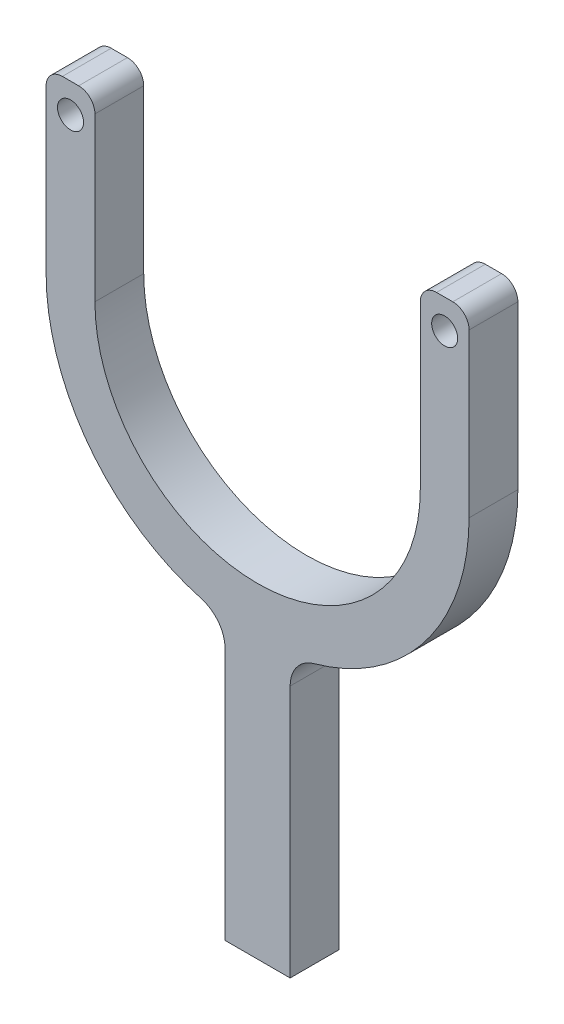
ISO-10303-21;
HEADER;
FILE_DESCRIPTION(('STEP AP214'),'2;1');
FILE_NAME('part.step','',(''),(''),'','','');
FILE_SCHEMA(('AUTOMOTIVE_DESIGN { 1 0 10303 214 1 1 1 1 }'));
ENDSEC;
DATA;
#1=APPLICATION_CONTEXT('core data for automotive mechanical design processes');
#2=APPLICATION_PROTOCOL_DEFINITION('international standard','automotive_design',2000,#1);
#3=PRODUCT_CONTEXT('',#1,'mechanical');
#4=PRODUCT('Part','Part','',(#3));
#5=PRODUCT_RELATED_PRODUCT_CATEGORY('part','',(#4));
#6=PRODUCT_DEFINITION_FORMATION('','',#4);
#7=PRODUCT_DEFINITION_CONTEXT('part definition',#1,'design');
#8=PRODUCT_DEFINITION('design','',#6,#7);
#9=PRODUCT_DEFINITION_SHAPE('','',#8);
#10=(LENGTH_UNIT() NAMED_UNIT(*) SI_UNIT(.MILLI.,.METRE.));
#11=(NAMED_UNIT(*) PLANE_ANGLE_UNIT() SI_UNIT($,.RADIAN.));
#12=(NAMED_UNIT(*) SI_UNIT($,.STERADIAN.) SOLID_ANGLE_UNIT());
#13=UNCERTAINTY_MEASURE_WITH_UNIT(LENGTH_MEASURE(1.E-05),#10,'distance_accuracy_value','');
#14=(GEOMETRIC_REPRESENTATION_CONTEXT(3) GLOBAL_UNCERTAINTY_ASSIGNED_CONTEXT((#13)) GLOBAL_UNIT_ASSIGNED_CONTEXT((#10,
#11,#12)) REPRESENTATION_CONTEXT('',''));
#15=CARTESIAN_POINT('',(0.,0.,0.));
#16=DIRECTION('',(0.,0.,1.));
#17=DIRECTION('',(1.,0.,0.));
#18=AXIS2_PLACEMENT_3D('',#15,#16,#17);
#19=CARTESIAN_POINT('',(0.,0.,7.5));
#20=DIRECTION('',(1.,0.,0.));
#21=DIRECTION('',(0.,1.,0.));
#22=AXIS2_PLACEMENT_3D('',#19,#20,#21);
#23=PLANE('',#22);
#24=DIRECTION('',(0.,-1.,0.));
#25=VECTOR('',#24,1.);
#26=CARTESIAN_POINT('',(0.,0.,7.5));
#27=LINE('',#26,#25);
#28=CARTESIAN_POINT('',(0.,-22.2841614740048,7.5));
#29=VERTEX_POINT('',#28);
#30=CARTESIAN_POINT('',(0.,-100.,7.5));
#31=VERTEX_POINT('',#30);
#32=EDGE_CURVE('E229',#29,#31,#27,.T.);
#33=ORIENTED_EDGE('',*,*,#32,.F.);
#34=DIRECTION('',(0.,0.,1.));
#35=VECTOR('',#34,1.);
#36=CARTESIAN_POINT('',(0.,-22.2841614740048,-7.5));
#37=LINE('',#36,#35);
#38=CARTESIAN_POINT('',(0.,-22.2841614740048,-7.5));
#39=VERTEX_POINT('',#38);
#40=EDGE_CURVE('E256',#29,#39,#37,.F.);
#41=ORIENTED_EDGE('',*,*,#40,.T.);
#42=DIRECTION('',(0.,-1.,0.));
#43=VECTOR('',#42,1.);
#44=CARTESIAN_POINT('',(0.,0.,-7.5));
#45=LINE('',#44,#43);
#46=CARTESIAN_POINT('',(0.,-100.,-7.5));
#47=VERTEX_POINT('',#46);
#48=EDGE_CURVE('E178',#39,#47,#45,.T.);
#49=ORIENTED_EDGE('',*,*,#48,.T.);
#50=DIRECTION('',(0.,0.,-1.));
#51=VECTOR('',#50,1.);
#52=CARTESIAN_POINT('',(0.,-100.,7.5));
#53=LINE('',#52,#51);
#54=EDGE_CURVE('E245',#31,#47,#53,.T.);
#55=ORIENTED_EDGE('',*,*,#54,.F.);
#56=EDGE_LOOP('',(#33,#41,#49,#55));
#57=FACE_BOUND('',#56,.T.);
#58=ADVANCED_FACE('F32',(#57),#23,.F.);
#59=CARTESIAN_POINT('',(20.,0.,7.5));
#60=DIRECTION('',(-1.,0.,0.));
#61=DIRECTION('',(0.,-1.,0.));
#62=AXIS2_PLACEMENT_3D('',#59,#60,#61);
#63=PLANE('',#62);
#64=DIRECTION('',(0.,1.,0.));
#65=VECTOR('',#64,1.);
#66=CARTESIAN_POINT('',(20.,0.,-7.5));
#67=LINE('',#66,#65);
#68=CARTESIAN_POINT('',(20.,-100.,-7.5));
#69=VERTEX_POINT('',#68);
#70=CARTESIAN_POINT('',(20.,-22.2841614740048,-7.5));
#71=VERTEX_POINT('',#70);
#72=EDGE_CURVE('E232',#69,#71,#67,.T.);
#73=ORIENTED_EDGE('',*,*,#72,.T.);
#74=DIRECTION('',(0.,0.,1.));
#75=VECTOR('',#74,1.);
#76=CARTESIAN_POINT('',(20.,-22.2841614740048,7.5));
#77=LINE('',#76,#75);
#78=CARTESIAN_POINT('',(20.,-22.2841614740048,7.5));
#79=VERTEX_POINT('',#78);
#80=EDGE_CURVE('E251',#71,#79,#77,.T.);
#81=ORIENTED_EDGE('',*,*,#80,.T.);
#82=DIRECTION('',(0.,1.,0.));
#83=VECTOR('',#82,1.);
#84=CARTESIAN_POINT('',(20.,0.,7.5));
#85=LINE('',#84,#83);
#86=CARTESIAN_POINT('',(20.,-100.,7.5));
#87=VERTEX_POINT('',#86);
#88=EDGE_CURVE('E234',#87,#79,#85,.T.);
#89=ORIENTED_EDGE('',*,*,#88,.F.);
#90=DIRECTION('',(0.,0.,-1.));
#91=VECTOR('',#90,1.);
#92=CARTESIAN_POINT('',(20.,-100.,7.5));
#93=LINE('',#92,#91);
#94=EDGE_CURVE('E237',#87,#69,#93,.T.);
#95=ORIENTED_EDGE('',*,*,#94,.T.);
#96=EDGE_LOOP('',(#73,#81,#89,#95));
#97=FACE_BOUND('',#96,.T.);
#98=ADVANCED_FACE('F366',(#97),#63,.F.);
#99=CARTESIAN_POINT('',(0.,-100.,7.5));
#100=DIRECTION('',(0.,1.,0.));
#101=DIRECTION('',(0.,0.,1.));
#102=AXIS2_PLACEMENT_3D('',#99,#100,#101);
#103=PLANE('',#102);
#104=DIRECTION('',(1.,0.,0.));
#105=VECTOR('',#104,1.);
#106=CARTESIAN_POINT('',(0.,-100.,-7.5));
#107=LINE('',#106,#105);
#108=EDGE_CURVE('E239',#47,#69,#107,.T.);
#109=ORIENTED_EDGE('',*,*,#108,.T.);
#110=ORIENTED_EDGE('',*,*,#94,.F.);
#111=DIRECTION('',(1.,0.,0.));
#112=VECTOR('',#111,1.);
#113=CARTESIAN_POINT('',(0.,-100.,7.5));
#114=LINE('',#113,#112);
#115=EDGE_CURVE('E231',#31,#87,#114,.T.);
#116=ORIENTED_EDGE('',*,*,#115,.F.);
#117=ORIENTED_EDGE('',*,*,#54,.T.);
#118=EDGE_LOOP('',(#109,#110,#116,#117));
#119=FACE_BOUND('',#118,.T.);
#120=ADVANCED_FACE('F329',(#119),#103,.F.);
#121=CARTESIAN_POINT('',(0.,-100.,7.5));
#122=DIRECTION('',(0.,0.,1.));
#123=DIRECTION('',(1.,0.,0.));
#124=AXIS2_PLACEMENT_3D('',#121,#122,#123);
#125=PLANE('',#124);
#126=CARTESIAN_POINT('',(67.5,96.,7.5));
#127=DIRECTION('',(0.,0.,1.));
#128=DIRECTION('',(1.,0.,0.));
#129=AXIS2_PLACEMENT_3D('',#126,#127,#128);
#130=CIRCLE('',#129,4.00000000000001);
#131=CARTESIAN_POINT('',(71.5,96.,7.5));
#132=VERTEX_POINT('',#131);
#133=EDGE_CURVE('E424',#132,#132,#130,.T.);
#134=ORIENTED_EDGE('',*,*,#133,.F.);
#135=EDGE_LOOP('',(#134));
#136=FACE_BOUND('',#135,.T.);
#137=CARTESIAN_POINT('',(-47.5,96.,7.5));
#138=DIRECTION('',(0.,0.,1.));
#139=DIRECTION('',(1.,0.,0.));
#140=AXIS2_PLACEMENT_3D('',#137,#138,#139);
#141=CIRCLE('',#140,4.00000000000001);
#142=CARTESIAN_POINT('',(-43.5,96.,7.5));
#143=VERTEX_POINT('',#142);
#144=EDGE_CURVE('E419',#143,#143,#141,.T.);
#145=ORIENTED_EDGE('',*,*,#144,.F.);
#146=EDGE_LOOP('',(#145));
#147=FACE_BOUND('',#146,.T.);
#148=DIRECTION('',(0.,1.,0.));
#149=VECTOR('',#148,1.);
#150=CARTESIAN_POINT('',(75.,50.,7.5));
#151=LINE('',#150,#149);
#152=CARTESIAN_POINT('',(75.,50.,7.5));
#153=VERTEX_POINT('',#152);
#154=CARTESIAN_POINT('',(75.,100.,7.5));
#155=VERTEX_POINT('',#154);
#156=EDGE_CURVE('E188',#153,#155,#151,.T.);
#157=ORIENTED_EDGE('',*,*,#156,.T.);
#158=CARTESIAN_POINT('',(70.,100.,7.5));
#159=DIRECTION('',(0.,0.,1.));
#160=DIRECTION('',(1.,0.,0.));
#161=AXIS2_PLACEMENT_3D('',#158,#159,#160);
#162=CIRCLE('',#161,5.);
#163=CARTESIAN_POINT('',(70.,105.,7.5));
#164=VERTEX_POINT('',#163);
#165=EDGE_CURVE('E284',#155,#164,#162,.T.);
#166=ORIENTED_EDGE('',*,*,#165,.T.);
#167=DIRECTION('',(1.,0.,0.));
#168=VECTOR('',#167,1.);
#169=CARTESIAN_POINT('',(60.,105.,7.5));
#170=LINE('',#169,#168);
#171=CARTESIAN_POINT('',(65.,105.,7.5));
#172=VERTEX_POINT('',#171);
#173=EDGE_CURVE('E185',#172,#164,#170,.T.);
#174=ORIENTED_EDGE('',*,*,#173,.F.);
#175=CARTESIAN_POINT('',(65.,100.,7.5));
#176=DIRECTION('',(0.,0.,1.));
#177=DIRECTION('',(1.,0.,0.));
#178=AXIS2_PLACEMENT_3D('',#175,#176,#177);
#179=CIRCLE('',#178,5.);
#180=CARTESIAN_POINT('',(60.,100.,7.5));
#181=VERTEX_POINT('',#180);
#182=EDGE_CURVE('E184',#172,#181,#179,.T.);
#183=ORIENTED_EDGE('',*,*,#182,.T.);
#184=DIRECTION('',(0.,1.,0.));
#185=VECTOR('',#184,1.);
#186=CARTESIAN_POINT('',(60.,50.,7.5));
#187=LINE('',#186,#185);
#188=CARTESIAN_POINT('',(60.,50.,7.5));
#189=VERTEX_POINT('',#188);
#190=EDGE_CURVE('E169',#189,#181,#187,.T.);
#191=ORIENTED_EDGE('',*,*,#190,.F.);
#192=CARTESIAN_POINT('',(10.,50.,7.5));
#193=DIRECTION('',(0.,0.,1.));
#194=DIRECTION('',(1.,0.,0.));
#195=AXIS2_PLACEMENT_3D('',#192,#193,#194);
#196=CIRCLE('',#195,50.);
#197=CARTESIAN_POINT('',(-40.,50.,7.5));
#198=VERTEX_POINT('',#197);
#199=EDGE_CURVE('E159',#198,#189,#196,.T.);
#200=ORIENTED_EDGE('',*,*,#199,.F.);
#201=DIRECTION('',(0.,-1.,0.));
#202=VECTOR('',#201,1.);
#203=CARTESIAN_POINT('',(-40.,50.,7.5));
#204=LINE('',#203,#202);
#205=CARTESIAN_POINT('',(-40.,100.,7.5));
#206=VERTEX_POINT('',#205);
#207=EDGE_CURVE('E168',#206,#198,#204,.T.);
#208=ORIENTED_EDGE('',*,*,#207,.F.);
#209=CARTESIAN_POINT('',(-45.,100.,7.5));
#210=DIRECTION('',(0.,0.,1.));
#211=DIRECTION('',(1.,0.,0.));
#212=AXIS2_PLACEMENT_3D('',#209,#210,#211);
#213=CIRCLE('',#212,5.);
#214=CARTESIAN_POINT('',(-45.,105.,7.5));
#215=VERTEX_POINT('',#214);
#216=EDGE_CURVE('E53',#206,#215,#213,.T.);
#217=ORIENTED_EDGE('',*,*,#216,.T.);
#218=DIRECTION('',(1.,0.,0.));
#219=VECTOR('',#218,1.);
#220=CARTESIAN_POINT('',(-55.,105.,7.5));
#221=LINE('',#220,#219);
#222=CARTESIAN_POINT('',(-50.,105.,7.5));
#223=VERTEX_POINT('',#222);
#224=EDGE_CURVE('E193',#223,#215,#221,.T.);
#225=ORIENTED_EDGE('',*,*,#224,.F.);
#226=CARTESIAN_POINT('',(-50.,100.,7.5));
#227=DIRECTION('',(0.,0.,1.));
#228=DIRECTION('',(1.,0.,0.));
#229=AXIS2_PLACEMENT_3D('',#226,#227,#228);
#230=CIRCLE('',#229,5.);
#231=CARTESIAN_POINT('',(-55.,100.,7.5));
#232=VERTEX_POINT('',#231);
#233=EDGE_CURVE('E47',#223,#232,#230,.T.);
#234=ORIENTED_EDGE('',*,*,#233,.T.);
#235=DIRECTION('',(0.,-1.,0.));
#236=VECTOR('',#235,1.);
#237=CARTESIAN_POINT('',(-55.,50.,7.5));
#238=LINE('',#237,#236);
#239=CARTESIAN_POINT('',(-55.,50.,7.5));
#240=VERTEX_POINT('',#239);
#241=EDGE_CURVE('E195',#232,#240,#238,.T.);
#242=ORIENTED_EDGE('',*,*,#241,.T.);
#243=CARTESIAN_POINT('',(10.,50.,7.5));
#244=DIRECTION('',(0.,0.,1.));
#245=DIRECTION('',(1.,0.,0.));
#246=AXIS2_PLACEMENT_3D('',#243,#244,#245);
#247=CIRCLE('',#246,65.);
#248=CARTESIAN_POINT('',(-7.33333333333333,-12.6462732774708,7.5));
#249=VERTEX_POINT('',#248);
#250=EDGE_CURVE('E198',#240,#249,#247,.T.);
#251=ORIENTED_EDGE('',*,*,#250,.T.);
#252=CARTESIAN_POINT('',(-10.,-22.2841614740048,7.5));
#253=DIRECTION('',(0.,0.,1.));
#254=DIRECTION('',(1.,0.,0.));
#255=AXIS2_PLACEMENT_3D('',#252,#253,#254);
#256=CIRCLE('',#255,10.);
#257=EDGE_CURVE('E262',#249,#29,#256,.F.);
#258=ORIENTED_EDGE('',*,*,#257,.T.);
#259=ORIENTED_EDGE('',*,*,#32,.T.);
#260=ORIENTED_EDGE('',*,*,#115,.T.);
#261=ORIENTED_EDGE('',*,*,#88,.T.);
#262=CARTESIAN_POINT('',(30.,-22.2841614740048,7.5));
#263=DIRECTION('',(0.,0.,1.));
#264=DIRECTION('',(1.,0.,0.));
#265=AXIS2_PLACEMENT_3D('',#262,#263,#264);
#266=CIRCLE('',#265,10.);
#267=CARTESIAN_POINT('',(27.3333333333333,-12.6462732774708,7.5));
#268=VERTEX_POINT('',#267);
#269=EDGE_CURVE('E260',#79,#268,#266,.F.);
#270=ORIENTED_EDGE('',*,*,#269,.T.);
#271=EDGE_CURVE('E197',#268,#153,#247,.T.);
#272=ORIENTED_EDGE('',*,*,#271,.T.);
#273=EDGE_LOOP('',(#157,#166,#174,#183,#191,#200,#208,#217,#225,#234,#242,#251,#258,#259,#260,
#261,#270,#272));
#274=FACE_BOUND('',#273,.T.);
#275=ADVANCED_FACE('F181',(#136,#147,#274),#125,.T.);
#276=CARTESIAN_POINT('',(0.,-100.,-7.5));
#277=DIRECTION('',(0.,0.,1.));
#278=DIRECTION('',(1.,0.,0.));
#279=AXIS2_PLACEMENT_3D('',#276,#277,#278);
#280=PLANE('',#279);
#281=CARTESIAN_POINT('',(67.5,96.,-7.5));
#282=DIRECTION('',(0.,0.,1.));
#283=DIRECTION('',(1.,0.,0.));
#284=AXIS2_PLACEMENT_3D('',#281,#282,#283);
#285=CIRCLE('',#284,4.00000000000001);
#286=CARTESIAN_POINT('',(71.5,96.,-7.5));
#287=VERTEX_POINT('',#286);
#288=EDGE_CURVE('E417',#287,#287,#285,.T.);
#289=ORIENTED_EDGE('',*,*,#288,.T.);
#290=EDGE_LOOP('',(#289));
#291=FACE_BOUND('',#290,.T.);
#292=CARTESIAN_POINT('',(-47.5,96.,-7.5));
#293=DIRECTION('',(0.,0.,1.));
#294=DIRECTION('',(1.,0.,0.));
#295=AXIS2_PLACEMENT_3D('',#292,#293,#294);
#296=CIRCLE('',#295,4.00000000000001);
#297=CARTESIAN_POINT('',(-43.5,96.,-7.5));
#298=VERTEX_POINT('',#297);
#299=EDGE_CURVE('E206',#298,#298,#296,.T.);
#300=ORIENTED_EDGE('',*,*,#299,.T.);
#301=EDGE_LOOP('',(#300));
#302=FACE_BOUND('',#301,.T.);
#303=DIRECTION('',(1.,0.,0.));
#304=VECTOR('',#303,1.);
#305=CARTESIAN_POINT('',(60.,105.,-7.5));
#306=LINE('',#305,#304);
#307=CARTESIAN_POINT('',(65.,105.,-7.5));
#308=VERTEX_POINT('',#307);
#309=CARTESIAN_POINT('',(70.,105.,-7.5));
#310=VERTEX_POINT('',#309);
#311=EDGE_CURVE('E205',#308,#310,#306,.T.);
#312=ORIENTED_EDGE('',*,*,#311,.T.);
#313=CARTESIAN_POINT('',(70.,100.,-7.5));
#314=DIRECTION('',(0.,0.,1.));
#315=DIRECTION('',(1.,0.,0.));
#316=AXIS2_PLACEMENT_3D('',#313,#314,#315);
#317=CIRCLE('',#316,5.);
#318=CARTESIAN_POINT('',(75.,100.,-7.5));
#319=VERTEX_POINT('',#318);
#320=EDGE_CURVE('E277',#310,#319,#317,.F.);
#321=ORIENTED_EDGE('',*,*,#320,.T.);
#322=DIRECTION('',(0.,1.,0.));
#323=VECTOR('',#322,1.);
#324=CARTESIAN_POINT('',(75.,50.,-7.5));
#325=LINE('',#324,#323);
#326=CARTESIAN_POINT('',(75.,50.,-7.5));
#327=VERTEX_POINT('',#326);
#328=EDGE_CURVE('E202',#327,#319,#325,.T.);
#329=ORIENTED_EDGE('',*,*,#328,.F.);
#330=CARTESIAN_POINT('',(10.,50.,-7.5));
#331=DIRECTION('',(0.,0.,1.));
#332=DIRECTION('',(1.,0.,0.));
#333=AXIS2_PLACEMENT_3D('',#330,#331,#332);
#334=CIRCLE('',#333,65.);
#335=CARTESIAN_POINT('',(27.3333333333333,-12.6462732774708,-7.5));
#336=VERTEX_POINT('',#335);
#337=EDGE_CURVE('E219',#336,#327,#334,.T.);
#338=ORIENTED_EDGE('',*,*,#337,.F.);
#339=CARTESIAN_POINT('',(30.,-22.2841614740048,-7.5));
#340=DIRECTION('',(0.,0.,1.));
#341=DIRECTION('',(1.,0.,0.));
#342=AXIS2_PLACEMENT_3D('',#339,#340,#341);
#343=CIRCLE('',#342,10.);
#344=EDGE_CURVE('E258',#336,#71,#343,.T.);
#345=ORIENTED_EDGE('',*,*,#344,.T.);
#346=ORIENTED_EDGE('',*,*,#72,.F.);
#347=ORIENTED_EDGE('',*,*,#108,.F.);
#348=ORIENTED_EDGE('',*,*,#48,.F.);
#349=CARTESIAN_POINT('',(-10.,-22.2841614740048,-7.5));
#350=DIRECTION('',(0.,0.,1.));
#351=DIRECTION('',(1.,0.,0.));
#352=AXIS2_PLACEMENT_3D('',#349,#350,#351);
#353=CIRCLE('',#352,10.);
#354=CARTESIAN_POINT('',(-7.33333333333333,-12.6462732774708,-7.5));
#355=VERTEX_POINT('',#354);
#356=EDGE_CURVE('E264',#39,#355,#353,.T.);
#357=ORIENTED_EDGE('',*,*,#356,.T.);
#358=CARTESIAN_POINT('',(-55.,50.,-7.5));
#359=VERTEX_POINT('',#358);
#360=EDGE_CURVE('E220',#359,#355,#334,.T.);
#361=ORIENTED_EDGE('',*,*,#360,.F.);
#362=DIRECTION('',(0.,-1.,0.));
#363=VECTOR('',#362,1.);
#364=CARTESIAN_POINT('',(-55.,50.,-7.5));
#365=LINE('',#364,#363);
#366=CARTESIAN_POINT('',(-55.,100.,-7.5));
#367=VERTEX_POINT('',#366);
#368=EDGE_CURVE('E217',#367,#359,#365,.T.);
#369=ORIENTED_EDGE('',*,*,#368,.F.);
#370=CARTESIAN_POINT('',(-50.,100.,-7.5));
#371=DIRECTION('',(0.,0.,1.));
#372=DIRECTION('',(1.,0.,0.));
#373=AXIS2_PLACEMENT_3D('',#370,#371,#372);
#374=CIRCLE('',#373,5.);
#375=CARTESIAN_POINT('',(-50.,105.,-7.5));
#376=VERTEX_POINT('',#375);
#377=EDGE_CURVE('E271',#367,#376,#374,.F.);
#378=ORIENTED_EDGE('',*,*,#377,.T.);
#379=DIRECTION('',(1.,0.,0.));
#380=VECTOR('',#379,1.);
#381=CARTESIAN_POINT('',(-55.,105.,-7.5));
#382=LINE('',#381,#380);
#383=CARTESIAN_POINT('',(-45.,105.,-7.5));
#384=VERTEX_POINT('',#383);
#385=EDGE_CURVE('E214',#376,#384,#382,.T.);
#386=ORIENTED_EDGE('',*,*,#385,.T.);
#387=CARTESIAN_POINT('',(-45.,100.,-7.5));
#388=DIRECTION('',(0.,0.,1.));
#389=DIRECTION('',(1.,0.,0.));
#390=AXIS2_PLACEMENT_3D('',#387,#388,#389);
#391=CIRCLE('',#390,5.);
#392=CARTESIAN_POINT('',(-40.,100.,-7.5));
#393=VERTEX_POINT('',#392);
#394=EDGE_CURVE('E273',#384,#393,#391,.F.);
#395=ORIENTED_EDGE('',*,*,#394,.T.);
#396=DIRECTION('',(0.,-1.,0.));
#397=VECTOR('',#396,1.);
#398=CARTESIAN_POINT('',(-40.,50.,-7.5));
#399=LINE('',#398,#397);
#400=CARTESIAN_POINT('',(-40.,50.,-7.5));
#401=VERTEX_POINT('',#400);
#402=EDGE_CURVE('E212',#393,#401,#399,.T.);
#403=ORIENTED_EDGE('',*,*,#402,.T.);
#404=CARTESIAN_POINT('',(10.,50.,-7.5));
#405=DIRECTION('',(0.,0.,1.));
#406=DIRECTION('',(1.,0.,0.));
#407=AXIS2_PLACEMENT_3D('',#404,#405,#406);
#408=CIRCLE('',#407,50.);
#409=CARTESIAN_POINT('',(60.,50.,-7.5));
#410=VERTEX_POINT('',#409);
#411=EDGE_CURVE('E210',#401,#410,#408,.T.);
#412=ORIENTED_EDGE('',*,*,#411,.T.);
#413=DIRECTION('',(0.,1.,0.));
#414=VECTOR('',#413,1.);
#415=CARTESIAN_POINT('',(60.,50.,-7.5));
#416=LINE('',#415,#414);
#417=CARTESIAN_POINT('',(60.,100.,-7.5));
#418=VERTEX_POINT('',#417);
#419=EDGE_CURVE('E177',#410,#418,#416,.T.);
#420=ORIENTED_EDGE('',*,*,#419,.T.);
#421=CARTESIAN_POINT('',(65.,100.,-7.5));
#422=DIRECTION('',(0.,0.,1.));
#423=DIRECTION('',(1.,0.,0.));
#424=AXIS2_PLACEMENT_3D('',#421,#422,#423);
#425=CIRCLE('',#424,5.);
#426=EDGE_CURVE('E275',#418,#308,#425,.F.);
#427=ORIENTED_EDGE('',*,*,#426,.T.);
#428=EDGE_LOOP('',(#312,#321,#329,#338,#345,#346,#347,#348,#357,#361,#369,#378,#386,#395,#403,
#412,#420,#427));
#429=FACE_BOUND('',#428,.T.);
#430=ADVANCED_FACE('F304',(#291,#302,#429),#280,.F.);
#431=CARTESIAN_POINT('',(10.,50.,7.5));
#432=DIRECTION('',(0.,0.,-1.));
#433=DIRECTION('',(-1.,0.,0.));
#434=AXIS2_PLACEMENT_3D('',#431,#432,#433);
#435=CYLINDRICAL_SURFACE('',#434,50.);
#436=ORIENTED_EDGE('',*,*,#199,.T.);
#437=DIRECTION('',(0.,0.,-1.));
#438=VECTOR('',#437,1.);
#439=CARTESIAN_POINT('',(60.,50.,7.5));
#440=LINE('',#439,#438);
#441=EDGE_CURVE('E163',#189,#410,#440,.T.);
#442=ORIENTED_EDGE('',*,*,#441,.T.);
#443=ORIENTED_EDGE('',*,*,#411,.F.);
#444=DIRECTION('',(0.,0.,-1.));
#445=VECTOR('',#444,1.);
#446=CARTESIAN_POINT('',(-40.,50.,7.5));
#447=LINE('',#446,#445);
#448=EDGE_CURVE('E166',#198,#401,#447,.T.);
#449=ORIENTED_EDGE('',*,*,#448,.F.);
#450=EDGE_LOOP('',(#436,#442,#443,#449));
#451=FACE_BOUND('',#450,.T.);
#452=ADVANCED_FACE('F161',(#451),#435,.F.);
#453=CARTESIAN_POINT('',(10.,50.,7.5));
#454=DIRECTION('',(0.,0.,-1.));
#455=DIRECTION('',(-1.,0.,0.));
#456=AXIS2_PLACEMENT_3D('',#453,#454,#455);
#457=CYLINDRICAL_SURFACE('',#456,65.);
#458=ORIENTED_EDGE('',*,*,#360,.T.);
#459=DIRECTION('',(0.,0.,-1.));
#460=VECTOR('',#459,1.);
#461=CARTESIAN_POINT('',(-7.33333333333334,-12.6462732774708,7.5));
#462=LINE('',#461,#460);
#463=EDGE_CURVE('E253',#355,#249,#462,.F.);
#464=ORIENTED_EDGE('',*,*,#463,.T.);
#465=ORIENTED_EDGE('',*,*,#250,.F.);
#466=DIRECTION('',(0.,0.,-1.));
#467=VECTOR('',#466,1.);
#468=CARTESIAN_POINT('',(-55.,50.,7.5));
#469=LINE('',#468,#467);
#470=EDGE_CURVE('E225',#240,#359,#469,.T.);
#471=ORIENTED_EDGE('',*,*,#470,.T.);
#472=EDGE_LOOP('',(#458,#464,#465,#471));
#473=FACE_BOUND('',#472,.T.);
#474=ADVANCED_FACE('F315',(#473),#457,.T.);
#475=ORIENTED_EDGE('',*,*,#271,.F.);
#476=DIRECTION('',(0.,0.,-1.));
#477=VECTOR('',#476,1.);
#478=CARTESIAN_POINT('',(27.3333333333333,-12.6462732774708,7.5));
#479=LINE('',#478,#477);
#480=EDGE_CURVE('E248',#268,#336,#479,.T.);
#481=ORIENTED_EDGE('',*,*,#480,.T.);
#482=ORIENTED_EDGE('',*,*,#337,.T.);
#483=DIRECTION('',(0.,0.,-1.));
#484=VECTOR('',#483,1.);
#485=CARTESIAN_POINT('',(75.,50.,7.5));
#486=LINE('',#485,#484);
#487=EDGE_CURVE('E201',#153,#327,#486,.T.);
#488=ORIENTED_EDGE('',*,*,#487,.F.);
#489=EDGE_LOOP('',(#475,#481,#482,#488));
#490=FACE_BOUND('',#489,.T.);
#491=ADVANCED_FACE('F340',(#490),#457,.T.);
#492=CARTESIAN_POINT('',(75.,50.,7.5));
#493=DIRECTION('',(-1.,0.,0.));
#494=DIRECTION('',(0.,-1.,0.));
#495=AXIS2_PLACEMENT_3D('',#492,#493,#494);
#496=PLANE('',#495);
#497=ORIENTED_EDGE('',*,*,#328,.T.);
#498=DIRECTION('',(0.,0.,-1.));
#499=VECTOR('',#498,1.);
#500=CARTESIAN_POINT('',(75.,100.,7.5));
#501=LINE('',#500,#499);
#502=EDGE_CURVE('E279',#319,#155,#501,.F.);
#503=ORIENTED_EDGE('',*,*,#502,.T.);
#504=ORIENTED_EDGE('',*,*,#156,.F.);
#505=ORIENTED_EDGE('',*,*,#487,.T.);
#506=EDGE_LOOP('',(#497,#503,#504,#505));
#507=FACE_BOUND('',#506,.T.);
#508=ADVANCED_FACE('F345',(#507),#496,.F.);
#509=CARTESIAN_POINT('',(60.,105.,7.5));
#510=DIRECTION('',(0.,1.,0.));
#511=DIRECTION('',(0.,0.,1.));
#512=AXIS2_PLACEMENT_3D('',#509,#510,#511);
#513=PLANE('',#512);
#514=ORIENTED_EDGE('',*,*,#173,.T.);
#515=DIRECTION('',(0.,0.,-1.));
#516=VECTOR('',#515,1.);
#517=CARTESIAN_POINT('',(70.,105.,-7.5));
#518=LINE('',#517,#516);
#519=EDGE_CURVE('E268',#164,#310,#518,.T.);
#520=ORIENTED_EDGE('',*,*,#519,.T.);
#521=ORIENTED_EDGE('',*,*,#311,.F.);
#522=DIRECTION('',(0.,0.,-1.));
#523=VECTOR('',#522,1.);
#524=CARTESIAN_POINT('',(65.,105.,7.5));
#525=LINE('',#524,#523);
#526=EDGE_CURVE('E266',#308,#172,#525,.F.);
#527=ORIENTED_EDGE('',*,*,#526,.T.);
#528=EDGE_LOOP('',(#514,#520,#521,#527));
#529=FACE_BOUND('',#528,.T.);
#530=ADVANCED_FACE('F352',(#529),#513,.T.);
#531=CARTESIAN_POINT('',(60.,50.,7.5));
#532=DIRECTION('',(-1.,0.,0.));
#533=DIRECTION('',(0.,-1.,0.));
#534=AXIS2_PLACEMENT_3D('',#531,#532,#533);
#535=PLANE('',#534);
#536=ORIENTED_EDGE('',*,*,#190,.T.);
#537=DIRECTION('',(0.,0.,-1.));
#538=VECTOR('',#537,1.);
#539=CARTESIAN_POINT('',(60.,100.,7.5));
#540=LINE('',#539,#538);
#541=EDGE_CURVE('E286',#181,#418,#540,.T.);
#542=ORIENTED_EDGE('',*,*,#541,.T.);
#543=ORIENTED_EDGE('',*,*,#419,.F.);
#544=ORIENTED_EDGE('',*,*,#441,.F.);
#545=EDGE_LOOP('',(#536,#542,#543,#544));
#546=FACE_BOUND('',#545,.T.);
#547=ADVANCED_FACE('F173',(#546),#535,.T.);
#548=CARTESIAN_POINT('',(-40.,50.,7.5));
#549=DIRECTION('',(1.,0.,0.));
#550=DIRECTION('',(0.,1.,0.));
#551=AXIS2_PLACEMENT_3D('',#548,#549,#550);
#552=PLANE('',#551);
#553=ORIENTED_EDGE('',*,*,#402,.F.);
#554=DIRECTION('',(0.,0.,-1.));
#555=VECTOR('',#554,1.);
#556=CARTESIAN_POINT('',(-40.,100.,7.5));
#557=LINE('',#556,#555);
#558=EDGE_CURVE('E40',#393,#206,#557,.F.);
#559=ORIENTED_EDGE('',*,*,#558,.T.);
#560=ORIENTED_EDGE('',*,*,#207,.T.);
#561=ORIENTED_EDGE('',*,*,#448,.T.);
#562=EDGE_LOOP('',(#553,#559,#560,#561));
#563=FACE_BOUND('',#562,.T.);
#564=ADVANCED_FACE('F295',(#563),#552,.T.);
#565=CARTESIAN_POINT('',(-55.,105.,7.5));
#566=DIRECTION('',(0.,1.,0.));
#567=DIRECTION('',(0.,0.,1.));
#568=AXIS2_PLACEMENT_3D('',#565,#566,#567);
#569=PLANE('',#568);
#570=ORIENTED_EDGE('',*,*,#224,.T.);
#571=DIRECTION('',(0.,0.,-1.));
#572=VECTOR('',#571,1.);
#573=CARTESIAN_POINT('',(-45.,105.,7.5));
#574=LINE('',#573,#572);
#575=EDGE_CURVE('E290',#215,#384,#574,.T.);
#576=ORIENTED_EDGE('',*,*,#575,.T.);
#577=ORIENTED_EDGE('',*,*,#385,.F.);
#578=DIRECTION('',(0.,0.,-1.));
#579=VECTOR('',#578,1.);
#580=CARTESIAN_POINT('',(-50.,105.,7.5));
#581=LINE('',#580,#579);
#582=EDGE_CURVE('E288',#376,#223,#581,.F.);
#583=ORIENTED_EDGE('',*,*,#582,.T.);
#584=EDGE_LOOP('',(#570,#576,#577,#583));
#585=FACE_BOUND('',#584,.T.);
#586=ADVANCED_FACE('F301',(#585),#569,.T.);
#587=CARTESIAN_POINT('',(-55.,50.,7.5));
#588=DIRECTION('',(1.,0.,0.));
#589=DIRECTION('',(0.,1.,0.));
#590=AXIS2_PLACEMENT_3D('',#587,#588,#589);
#591=PLANE('',#590);
#592=ORIENTED_EDGE('',*,*,#241,.F.);
#593=DIRECTION('',(0.,0.,-1.));
#594=VECTOR('',#593,1.);
#595=CARTESIAN_POINT('',(-55.,100.,-7.5));
#596=LINE('',#595,#594);
#597=EDGE_CURVE('E11',#232,#367,#596,.T.);
#598=ORIENTED_EDGE('',*,*,#597,.T.);
#599=ORIENTED_EDGE('',*,*,#368,.T.);
#600=ORIENTED_EDGE('',*,*,#470,.F.);
#601=EDGE_LOOP('',(#592,#598,#599,#600));
#602=FACE_BOUND('',#601,.T.);
#603=ADVANCED_FACE('F310',(#602),#591,.F.);
#604=CARTESIAN_POINT('',(30.,-22.2841614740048,7.5));
#605=DIRECTION('',(0.,0.,-1.));
#606=DIRECTION('',(-1.,0.,0.));
#607=AXIS2_PLACEMENT_3D('',#604,#605,#606);
#608=CYLINDRICAL_SURFACE('',#607,10.);
#609=ORIENTED_EDGE('',*,*,#269,.F.);
#610=ORIENTED_EDGE('',*,*,#80,.F.);
#611=ORIENTED_EDGE('',*,*,#344,.F.);
#612=ORIENTED_EDGE('',*,*,#480,.F.);
#613=EDGE_LOOP('',(#609,#610,#611,#612));
#614=FACE_BOUND('',#613,.T.);
#615=ADVANCED_FACE('F337',(#614),#608,.F.);
#616=CARTESIAN_POINT('',(-10.,-22.2841614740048,7.5));
#617=DIRECTION('',(0.,0.,-1.));
#618=DIRECTION('',(-1.,0.,0.));
#619=AXIS2_PLACEMENT_3D('',#616,#617,#618);
#620=CYLINDRICAL_SURFACE('',#619,10.);
#621=ORIENTED_EDGE('',*,*,#356,.F.);
#622=ORIENTED_EDGE('',*,*,#40,.F.);
#623=ORIENTED_EDGE('',*,*,#257,.F.);
#624=ORIENTED_EDGE('',*,*,#463,.F.);
#625=EDGE_LOOP('',(#621,#622,#623,#624));
#626=FACE_BOUND('',#625,.T.);
#627=ADVANCED_FACE('F319',(#626),#620,.F.);
#628=CARTESIAN_POINT('',(-47.5,96.,-7.5));
#629=DIRECTION('',(0.,0.,1.));
#630=DIRECTION('',(1.,0.,0.));
#631=AXIS2_PLACEMENT_3D('',#628,#629,#630);
#632=CYLINDRICAL_SURFACE('',#631,4.00000000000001);
#633=ORIENTED_EDGE('',*,*,#299,.F.);
#634=EDGE_LOOP('',(#633));
#635=FACE_BOUND('',#634,.T.);
#636=ORIENTED_EDGE('',*,*,#144,.T.);
#637=EDGE_LOOP('',(#636));
#638=FACE_BOUND('',#637,.T.);
#639=ADVANCED_FACE('F377',(#635,#638),#632,.F.);
#640=CARTESIAN_POINT('',(67.5,96.,-7.5));
#641=DIRECTION('',(0.,0.,1.));
#642=DIRECTION('',(1.,0.,0.));
#643=AXIS2_PLACEMENT_3D('',#640,#641,#642);
#644=CYLINDRICAL_SURFACE('',#643,4.00000000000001);
#645=ORIENTED_EDGE('',*,*,#288,.F.);
#646=EDGE_LOOP('',(#645));
#647=FACE_BOUND('',#646,.T.);
#648=ORIENTED_EDGE('',*,*,#133,.T.);
#649=EDGE_LOOP('',(#648));
#650=FACE_BOUND('',#649,.T.);
#651=ADVANCED_FACE('F363',(#647,#650),#644,.F.);
#652=CARTESIAN_POINT('',(70.,100.,7.5));
#653=DIRECTION('',(0.,0.,1.));
#654=DIRECTION('',(1.,0.,0.));
#655=AXIS2_PLACEMENT_3D('',#652,#653,#654);
#656=CYLINDRICAL_SURFACE('',#655,5.);
#657=ORIENTED_EDGE('',*,*,#165,.F.);
#658=ORIENTED_EDGE('',*,*,#502,.F.);
#659=ORIENTED_EDGE('',*,*,#320,.F.);
#660=ORIENTED_EDGE('',*,*,#519,.F.);
#661=EDGE_LOOP('',(#657,#658,#659,#660));
#662=FACE_BOUND('',#661,.T.);
#663=ADVANCED_FACE('F349',(#662),#656,.T.);
#664=CARTESIAN_POINT('',(65.,100.,7.5));
#665=DIRECTION('',(0.,0.,-1.));
#666=DIRECTION('',(-1.,0.,0.));
#667=AXIS2_PLACEMENT_3D('',#664,#665,#666);
#668=CYLINDRICAL_SURFACE('',#667,5.);
#669=ORIENTED_EDGE('',*,*,#182,.F.);
#670=ORIENTED_EDGE('',*,*,#526,.F.);
#671=ORIENTED_EDGE('',*,*,#426,.F.);
#672=ORIENTED_EDGE('',*,*,#541,.F.);
#673=EDGE_LOOP('',(#669,#670,#671,#672));
#674=FACE_BOUND('',#673,.T.);
#675=ADVANCED_FACE('F356',(#674),#668,.T.);
#676=CARTESIAN_POINT('',(-45.,100.,7.5));
#677=DIRECTION('',(0.,0.,-1.));
#678=DIRECTION('',(-1.,0.,0.));
#679=AXIS2_PLACEMENT_3D('',#676,#677,#678);
#680=CYLINDRICAL_SURFACE('',#679,5.);
#681=ORIENTED_EDGE('',*,*,#216,.F.);
#682=ORIENTED_EDGE('',*,*,#558,.F.);
#683=ORIENTED_EDGE('',*,*,#394,.F.);
#684=ORIENTED_EDGE('',*,*,#575,.F.);
#685=EDGE_LOOP('',(#681,#682,#683,#684));
#686=FACE_BOUND('',#685,.T.);
#687=ADVANCED_FACE('F298',(#686),#680,.T.);
#688=CARTESIAN_POINT('',(-50.,100.,7.5));
#689=DIRECTION('',(0.,0.,1.));
#690=DIRECTION('',(1.,0.,0.));
#691=AXIS2_PLACEMENT_3D('',#688,#689,#690);
#692=CYLINDRICAL_SURFACE('',#691,5.);
#693=ORIENTED_EDGE('',*,*,#233,.F.);
#694=ORIENTED_EDGE('',*,*,#582,.F.);
#695=ORIENTED_EDGE('',*,*,#377,.F.);
#696=ORIENTED_EDGE('',*,*,#597,.F.);
#697=EDGE_LOOP('',(#693,#694,#695,#696));
#698=FACE_BOUND('',#697,.T.);
#699=ADVANCED_FACE('F34',(#698),#692,.T.);
#700=CLOSED_SHELL('',(#58,#98,#120,#275,#430,#452,#474,#491,#508,#530,#547,#564,#586,#603,#615,
#627,#639,#651,#663,#675,#687,#699));
#701=MANIFOLD_SOLID_BREP('B2',#700);
#702=ADVANCED_BREP_SHAPE_REPRESENTATION('',(#18,#701),#14);
#703=SHAPE_DEFINITION_REPRESENTATION(#9,#702);
ENDSEC;
END-ISO-10303-21;
